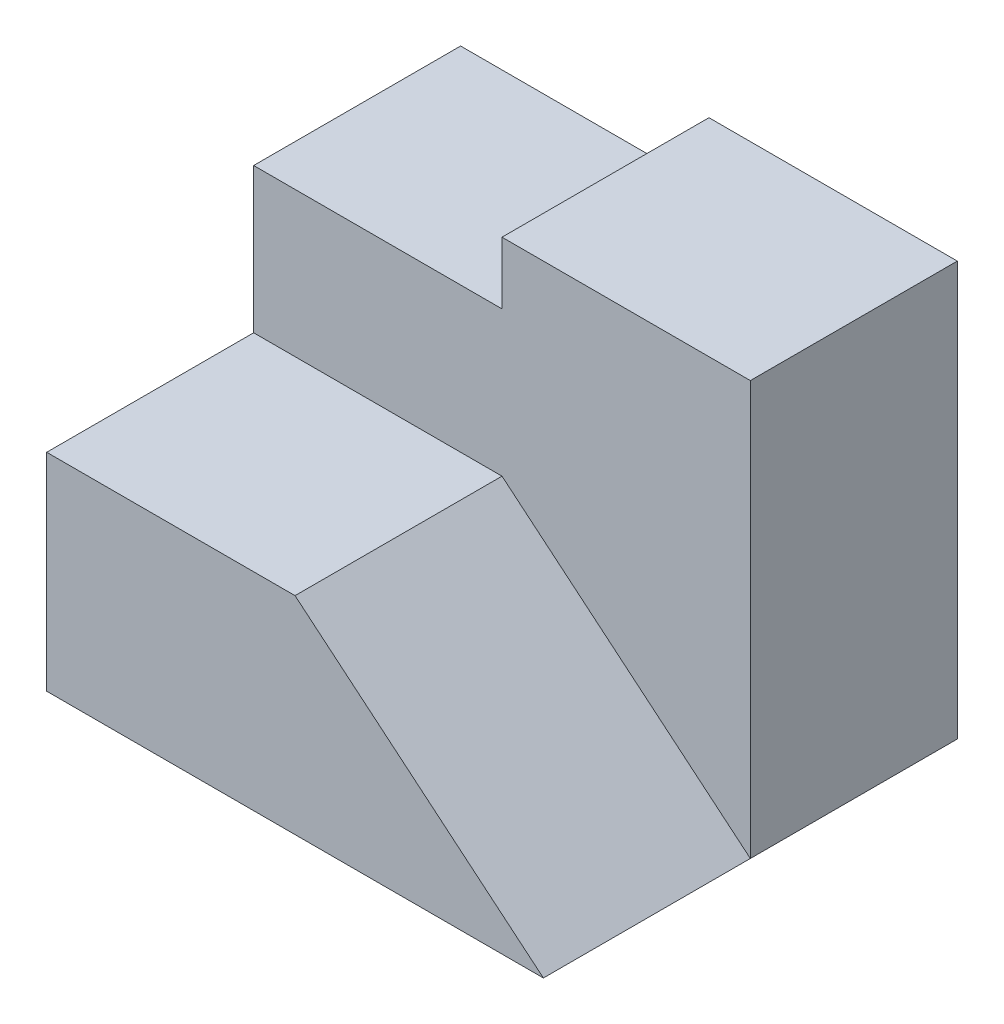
ISO-10303-21;
HEADER;
FILE_DESCRIPTION(('STEP AP214'),'2;1');
FILE_NAME('part.step','',(''),(''),'','','');
FILE_SCHEMA(('AUTOMOTIVE_DESIGN { 1 0 10303 214 1 1 1 1 }'));
ENDSEC;
DATA;
#1=APPLICATION_CONTEXT('core data for automotive mechanical design processes');
#2=APPLICATION_PROTOCOL_DEFINITION('international standard','automotive_design',2000,#1);
#3=PRODUCT_CONTEXT('',#1,'mechanical');
#4=PRODUCT('Part','Part','',(#3));
#5=PRODUCT_RELATED_PRODUCT_CATEGORY('part','',(#4));
#6=PRODUCT_DEFINITION_FORMATION('','',#4);
#7=PRODUCT_DEFINITION_CONTEXT('part definition',#1,'design');
#8=PRODUCT_DEFINITION('design','',#6,#7);
#9=PRODUCT_DEFINITION_SHAPE('','',#8);
#10=(LENGTH_UNIT() NAMED_UNIT(*) SI_UNIT(.MILLI.,.METRE.));
#11=(NAMED_UNIT(*) PLANE_ANGLE_UNIT() SI_UNIT($,.RADIAN.));
#12=(NAMED_UNIT(*) SI_UNIT($,.STERADIAN.) SOLID_ANGLE_UNIT());
#13=UNCERTAINTY_MEASURE_WITH_UNIT(LENGTH_MEASURE(1.E-05),#10,'distance_accuracy_value','');
#14=(GEOMETRIC_REPRESENTATION_CONTEXT(3) GLOBAL_UNCERTAINTY_ASSIGNED_CONTEXT((#13)) GLOBAL_UNIT_ASSIGNED_CONTEXT((#10,
#11,#12)) REPRESENTATION_CONTEXT('',''));
#15=CARTESIAN_POINT('',(0.,0.,0.));
#16=DIRECTION('',(0.,0.,1.));
#17=DIRECTION('',(1.,0.,0.));
#18=AXIS2_PLACEMENT_3D('',#15,#16,#17);
#19=CARTESIAN_POINT('',(0.,0.,-50.));
#20=DIRECTION('',(-1.,0.,0.));
#21=DIRECTION('',(0.,0.,1.));
#22=AXIS2_PLACEMENT_3D('',#19,#20,#21);
#23=PLANE('',#22);
#24=DIRECTION('',(0.,-1.,0.));
#25=VECTOR('',#24,1.);
#26=CARTESIAN_POINT('',(0.,0.,0.));
#27=LINE('',#26,#25);
#28=CARTESIAN_POINT('',(0.,50.,0.));
#29=VERTEX_POINT('',#28);
#30=CARTESIAN_POINT('',(0.,0.,0.));
#31=VERTEX_POINT('',#30);
#32=EDGE_CURVE('E176',#29,#31,#27,.T.);
#33=ORIENTED_EDGE('',*,*,#32,.F.);
#34=DIRECTION('',(0.,0.,1.));
#35=VECTOR('',#34,1.);
#36=CARTESIAN_POINT('',(0.,50.,-50.));
#37=LINE('',#36,#35);
#38=CARTESIAN_POINT('',(0.,50.,-50.));
#39=VERTEX_POINT('',#38);
#40=EDGE_CURVE('E11',#39,#29,#37,.T.);
#41=ORIENTED_EDGE('',*,*,#40,.F.);
#42=DIRECTION('',(0.,1.,0.));
#43=VECTOR('',#42,1.);
#44=CARTESIAN_POINT('',(0.,0.,-50.));
#45=LINE('',#44,#43);
#46=CARTESIAN_POINT('',(0.,85.,-50.));
#47=VERTEX_POINT('',#46);
#48=EDGE_CURVE('E98',#39,#47,#45,.T.);
#49=ORIENTED_EDGE('',*,*,#48,.T.);
#50=DIRECTION('',(0.,0.,1.));
#51=VECTOR('',#50,1.);
#52=CARTESIAN_POINT('',(0.,85.,-100.));
#53=LINE('',#52,#51);
#54=CARTESIAN_POINT('',(0.,85.,-100.));
#55=VERTEX_POINT('',#54);
#56=EDGE_CURVE('E172',#55,#47,#53,.T.);
#57=ORIENTED_EDGE('',*,*,#56,.F.);
#58=DIRECTION('',(0.,1.,0.));
#59=VECTOR('',#58,1.);
#60=CARTESIAN_POINT('',(0.,0.,-100.));
#61=LINE('',#60,#59);
#62=CARTESIAN_POINT('',(0.,0.,-100.));
#63=VERTEX_POINT('',#62);
#64=EDGE_CURVE('E193',#63,#55,#61,.T.);
#65=ORIENTED_EDGE('',*,*,#64,.F.);
#66=DIRECTION('',(0.,0.,1.));
#67=VECTOR('',#66,1.);
#68=CARTESIAN_POINT('',(0.,0.,-50.));
#69=LINE('',#68,#67);
#70=EDGE_CURVE('E90',#63,#31,#69,.T.);
#71=ORIENTED_EDGE('',*,*,#70,.T.);
#72=EDGE_LOOP('',(#33,#41,#49,#57,#65,#71));
#73=FACE_BOUND('',#72,.T.);
#74=ADVANCED_FACE('F31',(#73),#23,.T.);
#75=CARTESIAN_POINT('',(0.,50.,-50.));
#76=DIRECTION('',(0.,1.,0.));
#77=DIRECTION('',(0.,0.,1.));
#78=AXIS2_PLACEMENT_3D('',#75,#76,#77);
#79=PLANE('',#78);
#80=DIRECTION('',(-1.,0.,0.));
#81=VECTOR('',#80,1.);
#82=CARTESIAN_POINT('',(0.,50.,0.));
#83=LINE('',#82,#81);
#84=CARTESIAN_POINT('',(60.,50.,0.));
#85=VERTEX_POINT('',#84);
#86=EDGE_CURVE('E78',#85,#29,#83,.T.);
#87=ORIENTED_EDGE('',*,*,#86,.F.);
#88=DIRECTION('',(0.,0.,1.));
#89=VECTOR('',#88,1.);
#90=CARTESIAN_POINT('',(60.,50.,-50.));
#91=LINE('',#90,#89);
#92=CARTESIAN_POINT('',(60.,50.,-50.));
#93=VERTEX_POINT('',#92);
#94=EDGE_CURVE('E41',#93,#85,#91,.T.);
#95=ORIENTED_EDGE('',*,*,#94,.F.);
#96=DIRECTION('',(-1.,0.,0.));
#97=VECTOR('',#96,1.);
#98=CARTESIAN_POINT('',(0.,50.,-50.));
#99=LINE('',#98,#97);
#100=EDGE_CURVE('E34',#93,#39,#99,.T.);
#101=ORIENTED_EDGE('',*,*,#100,.T.);
#102=ORIENTED_EDGE('',*,*,#40,.T.);
#103=EDGE_LOOP('',(#87,#95,#101,#102));
#104=FACE_BOUND('',#103,.T.);
#105=ADVANCED_FACE('F82',(#104),#79,.T.);
#106=CARTESIAN_POINT('',(60.,50.,-50.));
#107=DIRECTION('',(0.64018439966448,0.768221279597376,0.));
#108=DIRECTION('',(-0.768221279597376,0.64018439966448,0.));
#109=AXIS2_PLACEMENT_3D('',#106,#107,#108);
#110=PLANE('',#109);
#111=DIRECTION('',(-0.768221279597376,0.64018439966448,0.));
#112=VECTOR('',#111,1.);
#113=CARTESIAN_POINT('',(60.,50.,0.));
#114=LINE('',#113,#112);
#115=CARTESIAN_POINT('',(120.,0.,0.));
#116=VERTEX_POINT('',#115);
#117=EDGE_CURVE('E67',#116,#85,#114,.T.);
#118=ORIENTED_EDGE('',*,*,#117,.F.);
#119=DIRECTION('',(0.,0.,1.));
#120=VECTOR('',#119,1.);
#121=CARTESIAN_POINT('',(120.,0.,-50.));
#122=LINE('',#121,#120);
#123=CARTESIAN_POINT('',(120.,0.,-50.));
#124=VERTEX_POINT('',#123);
#125=EDGE_CURVE('E72',#124,#116,#122,.T.);
#126=ORIENTED_EDGE('',*,*,#125,.F.);
#127=DIRECTION('',(-0.768221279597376,0.64018439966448,0.));
#128=VECTOR('',#127,1.);
#129=CARTESIAN_POINT('',(60.,50.,-50.));
#130=LINE('',#129,#128);
#131=EDGE_CURVE('E69',#124,#93,#130,.T.);
#132=ORIENTED_EDGE('',*,*,#131,.T.);
#133=ORIENTED_EDGE('',*,*,#94,.T.);
#134=EDGE_LOOP('',(#118,#126,#132,#133));
#135=FACE_BOUND('',#134,.T.);
#136=ADVANCED_FACE('F65',(#135),#110,.T.);
#137=CARTESIAN_POINT('',(0.,0.,-50.));
#138=DIRECTION('',(0.,-1.,0.));
#139=DIRECTION('',(0.,0.,-1.));
#140=AXIS2_PLACEMENT_3D('',#137,#138,#139);
#141=PLANE('',#140);
#142=DIRECTION('',(1.,0.,0.));
#143=VECTOR('',#142,1.);
#144=CARTESIAN_POINT('',(0.,0.,0.));
#145=LINE('',#144,#143);
#146=EDGE_CURVE('E80',#31,#116,#145,.T.);
#147=ORIENTED_EDGE('',*,*,#146,.F.);
#148=ORIENTED_EDGE('',*,*,#70,.F.);
#149=DIRECTION('',(-1.,0.,0.));
#150=VECTOR('',#149,1.);
#151=CARTESIAN_POINT('',(0.,0.,-100.));
#152=LINE('',#151,#150);
#153=CARTESIAN_POINT('',(120.,0.,-100.));
#154=VERTEX_POINT('',#153);
#155=EDGE_CURVE('E186',#154,#63,#152,.T.);
#156=ORIENTED_EDGE('',*,*,#155,.F.);
#157=DIRECTION('',(0.,0.,1.));
#158=VECTOR('',#157,1.);
#159=CARTESIAN_POINT('',(120.,0.,-100.));
#160=LINE('',#159,#158);
#161=EDGE_CURVE('E162',#154,#124,#160,.T.);
#162=ORIENTED_EDGE('',*,*,#161,.T.);
#163=ORIENTED_EDGE('',*,*,#125,.T.);
#164=EDGE_LOOP('',(#147,#148,#156,#162,#163));
#165=FACE_BOUND('',#164,.T.);
#166=ADVANCED_FACE('F192',(#165),#141,.T.);
#167=CARTESIAN_POINT('',(0.,50.,0.));
#168=DIRECTION('',(0.,0.,-1.));
#169=DIRECTION('',(-1.,0.,0.));
#170=AXIS2_PLACEMENT_3D('',#167,#168,#169);
#171=PLANE('',#170);
#172=ORIENTED_EDGE('',*,*,#32,.T.);
#173=ORIENTED_EDGE('',*,*,#146,.T.);
#174=ORIENTED_EDGE('',*,*,#117,.T.);
#175=ORIENTED_EDGE('',*,*,#86,.T.);
#176=EDGE_LOOP('',(#172,#173,#174,#175));
#177=FACE_BOUND('',#176,.T.);
#178=ADVANCED_FACE('F77',(#177),#171,.F.);
#179=CARTESIAN_POINT('',(60.,85.,-100.));
#180=DIRECTION('',(0.,-1.,0.));
#181=DIRECTION('',(0.,0.,-1.));
#182=AXIS2_PLACEMENT_3D('',#179,#180,#181);
#183=PLANE('',#182);
#184=DIRECTION('',(1.,0.,0.));
#185=VECTOR('',#184,1.);
#186=CARTESIAN_POINT('',(60.,85.,-50.));
#187=LINE('',#186,#185);
#188=CARTESIAN_POINT('',(60.,85.,-50.));
#189=VERTEX_POINT('',#188);
#190=EDGE_CURVE('E168',#47,#189,#187,.T.);
#191=ORIENTED_EDGE('',*,*,#190,.T.);
#192=DIRECTION('',(0.,0.,1.));
#193=VECTOR('',#192,1.);
#194=CARTESIAN_POINT('',(60.,85.,-100.));
#195=LINE('',#194,#193);
#196=CARTESIAN_POINT('',(60.,85.,-100.));
#197=VERTEX_POINT('',#196);
#198=EDGE_CURVE('E156',#197,#189,#195,.T.);
#199=ORIENTED_EDGE('',*,*,#198,.F.);
#200=DIRECTION('',(1.,0.,0.));
#201=VECTOR('',#200,1.);
#202=CARTESIAN_POINT('',(60.,85.,-100.));
#203=LINE('',#202,#201);
#204=EDGE_CURVE('E144',#55,#197,#203,.T.);
#205=ORIENTED_EDGE('',*,*,#204,.F.);
#206=ORIENTED_EDGE('',*,*,#56,.T.);
#207=EDGE_LOOP('',(#191,#199,#205,#206));
#208=FACE_BOUND('',#207,.T.);
#209=ADVANCED_FACE('F188',(#208),#183,.F.);
#210=CARTESIAN_POINT('',(60.,100.,-100.));
#211=DIRECTION('',(1.,0.,0.));
#212=DIRECTION('',(0.,0.,-1.));
#213=AXIS2_PLACEMENT_3D('',#210,#211,#212);
#214=PLANE('',#213);
#215=DIRECTION('',(0.,1.,0.));
#216=VECTOR('',#215,1.);
#217=CARTESIAN_POINT('',(60.,100.,-50.));
#218=LINE('',#217,#216);
#219=CARTESIAN_POINT('',(60.,100.,-50.));
#220=VERTEX_POINT('',#219);
#221=EDGE_CURVE('E153',#189,#220,#218,.T.);
#222=ORIENTED_EDGE('',*,*,#221,.T.);
#223=DIRECTION('',(0.,0.,1.));
#224=VECTOR('',#223,1.);
#225=CARTESIAN_POINT('',(60.,100.,-100.));
#226=LINE('',#225,#224);
#227=CARTESIAN_POINT('',(60.,100.,-100.));
#228=VERTEX_POINT('',#227);
#229=EDGE_CURVE('E150',#228,#220,#226,.T.);
#230=ORIENTED_EDGE('',*,*,#229,.F.);
#231=DIRECTION('',(0.,1.,0.));
#232=VECTOR('',#231,1.);
#233=CARTESIAN_POINT('',(60.,100.,-100.));
#234=LINE('',#233,#232);
#235=EDGE_CURVE('E137',#197,#228,#234,.T.);
#236=ORIENTED_EDGE('',*,*,#235,.F.);
#237=ORIENTED_EDGE('',*,*,#198,.T.);
#238=EDGE_LOOP('',(#222,#230,#236,#237));
#239=FACE_BOUND('',#238,.T.);
#240=ADVANCED_FACE('F151',(#239),#214,.F.);
#241=CARTESIAN_POINT('',(120.,100.,-100.));
#242=DIRECTION('',(0.,-1.,0.));
#243=DIRECTION('',(0.,0.,-1.));
#244=AXIS2_PLACEMENT_3D('',#241,#242,#243);
#245=PLANE('',#244);
#246=DIRECTION('',(1.,0.,0.));
#247=VECTOR('',#246,1.);
#248=CARTESIAN_POINT('',(120.,100.,-50.));
#249=LINE('',#248,#247);
#250=CARTESIAN_POINT('',(120.,100.,-50.));
#251=VERTEX_POINT('',#250);
#252=EDGE_CURVE('E187',#220,#251,#249,.T.);
#253=ORIENTED_EDGE('',*,*,#252,.T.);
#254=DIRECTION('',(0.,0.,1.));
#255=VECTOR('',#254,1.);
#256=CARTESIAN_POINT('',(120.,100.,-100.));
#257=LINE('',#256,#255);
#258=CARTESIAN_POINT('',(120.,100.,-100.));
#259=VERTEX_POINT('',#258);
#260=EDGE_CURVE('E157',#259,#251,#257,.T.);
#261=ORIENTED_EDGE('',*,*,#260,.F.);
#262=DIRECTION('',(1.,0.,0.));
#263=VECTOR('',#262,1.);
#264=CARTESIAN_POINT('',(120.,100.,-100.));
#265=LINE('',#264,#263);
#266=EDGE_CURVE('E141',#228,#259,#265,.T.);
#267=ORIENTED_EDGE('',*,*,#266,.F.);
#268=ORIENTED_EDGE('',*,*,#229,.T.);
#269=EDGE_LOOP('',(#253,#261,#267,#268));
#270=FACE_BOUND('',#269,.T.);
#271=ADVANCED_FACE('F159',(#270),#245,.F.);
#272=CARTESIAN_POINT('',(120.,100.,-100.));
#273=DIRECTION('',(-1.,0.,0.));
#274=DIRECTION('',(0.,-1.,0.));
#275=AXIS2_PLACEMENT_3D('',#272,#273,#274);
#276=PLANE('',#275);
#277=DIRECTION('',(0.,-1.,0.));
#278=VECTOR('',#277,1.);
#279=CARTESIAN_POINT('',(120.,100.,-50.));
#280=LINE('',#279,#278);
#281=EDGE_CURVE('E184',#251,#124,#280,.T.);
#282=ORIENTED_EDGE('',*,*,#281,.T.);
#283=ORIENTED_EDGE('',*,*,#161,.F.);
#284=DIRECTION('',(0.,-1.,0.));
#285=VECTOR('',#284,1.);
#286=CARTESIAN_POINT('',(120.,100.,-100.));
#287=LINE('',#286,#285);
#288=EDGE_CURVE('E106',#259,#154,#287,.T.);
#289=ORIENTED_EDGE('',*,*,#288,.F.);
#290=ORIENTED_EDGE('',*,*,#260,.T.);
#291=EDGE_LOOP('',(#282,#283,#289,#290));
#292=FACE_BOUND('',#291,.T.);
#293=ADVANCED_FACE('F191',(#292),#276,.F.);
#294=CARTESIAN_POINT('',(60.,0.,-100.));
#295=DIRECTION('',(0.,0.,-1.));
#296=DIRECTION('',(-1.,0.,0.));
#297=AXIS2_PLACEMENT_3D('',#294,#295,#296);
#298=PLANE('',#297);
#299=ORIENTED_EDGE('',*,*,#155,.T.);
#300=ORIENTED_EDGE('',*,*,#64,.T.);
#301=ORIENTED_EDGE('',*,*,#204,.T.);
#302=ORIENTED_EDGE('',*,*,#235,.T.);
#303=ORIENTED_EDGE('',*,*,#266,.T.);
#304=ORIENTED_EDGE('',*,*,#288,.T.);
#305=EDGE_LOOP('',(#299,#300,#301,#302,#303,#304));
#306=FACE_BOUND('',#305,.T.);
#307=ADVANCED_FACE('F139',(#306),#298,.T.);
#308=CARTESIAN_POINT('',(60.,0.,-50.));
#309=DIRECTION('',(0.,0.,-1.));
#310=DIRECTION('',(-1.,0.,0.));
#311=AXIS2_PLACEMENT_3D('',#308,#309,#310);
#312=PLANE('',#311);
#313=ORIENTED_EDGE('',*,*,#100,.F.);
#314=ORIENTED_EDGE('',*,*,#131,.F.);
#315=ORIENTED_EDGE('',*,*,#281,.F.);
#316=ORIENTED_EDGE('',*,*,#252,.F.);
#317=ORIENTED_EDGE('',*,*,#221,.F.);
#318=ORIENTED_EDGE('',*,*,#190,.F.);
#319=ORIENTED_EDGE('',*,*,#48,.F.);
#320=EDGE_LOOP('',(#313,#314,#315,#316,#317,#318,#319));
#321=FACE_BOUND('',#320,.T.);
#322=ADVANCED_FACE('F189',(#321),#312,.F.);
#323=CLOSED_SHELL('',(#74,#105,#136,#166,#178,#209,#240,#271,#293,#307,#322));
#324=MANIFOLD_SOLID_BREP('B2',#323);
#325=ADVANCED_BREP_SHAPE_REPRESENTATION('',(#18,#324),#14);
#326=SHAPE_DEFINITION_REPRESENTATION(#9,#325);
ENDSEC;
END-ISO-10303-21;
